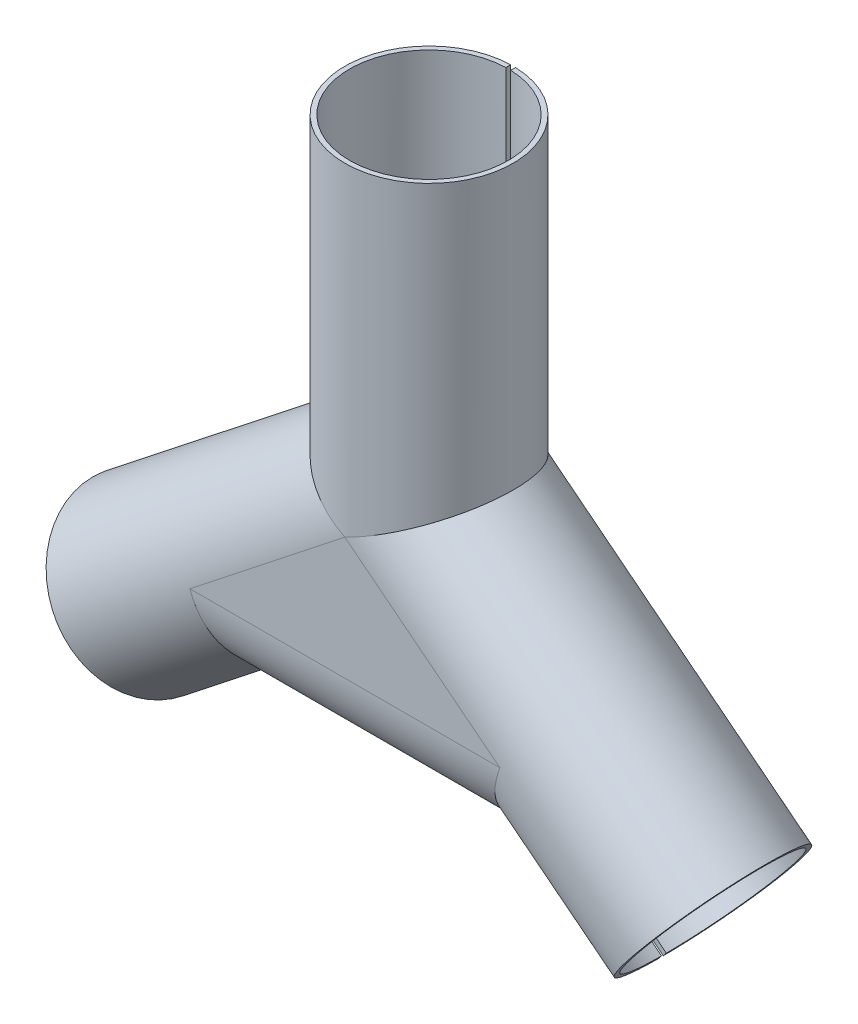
ISO-10303-21;
HEADER;
FILE_DESCRIPTION(('STEP AP214'),'2;1');
FILE_NAME('part.step','',(''),(''),'','','');
FILE_SCHEMA(('AUTOMOTIVE_DESIGN { 1 0 10303 214 1 1 1 1 }'));
ENDSEC;
DATA;
#1=APPLICATION_CONTEXT('core data for automotive mechanical design processes');
#2=APPLICATION_PROTOCOL_DEFINITION('international standard','automotive_design',2000,#1);
#3=PRODUCT_CONTEXT('',#1,'mechanical');
#4=PRODUCT('Part','Part','',(#3));
#5=PRODUCT_RELATED_PRODUCT_CATEGORY('part','',(#4));
#6=PRODUCT_DEFINITION_FORMATION('','',#4);
#7=PRODUCT_DEFINITION_CONTEXT('part definition',#1,'design');
#8=PRODUCT_DEFINITION('design','',#6,#7);
#9=PRODUCT_DEFINITION_SHAPE('','',#8);
#10=(LENGTH_UNIT() NAMED_UNIT(*) SI_UNIT(.MILLI.,.METRE.));
#11=(NAMED_UNIT(*) PLANE_ANGLE_UNIT() SI_UNIT($,.RADIAN.));
#12=(NAMED_UNIT(*) SI_UNIT($,.STERADIAN.) SOLID_ANGLE_UNIT());
#13=UNCERTAINTY_MEASURE_WITH_UNIT(LENGTH_MEASURE(1.E-05),#10,'distance_accuracy_value','');
#14=(GEOMETRIC_REPRESENTATION_CONTEXT(3) GLOBAL_UNCERTAINTY_ASSIGNED_CONTEXT((#13)) GLOBAL_UNIT_ASSIGNED_CONTEXT((#10,
#11,#12)) REPRESENTATION_CONTEXT('',''));
#15=CARTESIAN_POINT('',(0.,0.,0.));
#16=DIRECTION('',(0.,0.,1.));
#17=DIRECTION('',(1.,0.,0.));
#18=AXIS2_PLACEMENT_3D('',#15,#16,#17);
#19=CARTESIAN_POINT('',(0.,0.,0.));
#20=DIRECTION('',(-0.785370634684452,-0.619025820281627,0.));
#21=DIRECTION('',(-0.619025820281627,0.785370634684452,0.));
#22=AXIS2_PLACEMENT_3D('',#19,#20,#21);
#23=CYLINDRICAL_SURFACE('',#22,17.4844566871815);
#24=DIRECTION('',(-0.785370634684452,-0.619025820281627,0.));
#25=VECTOR('',#24,1.);
#26=CARTESIAN_POINT('',(10.8189036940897,-13.726162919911,0.5));
#27=LINE('',#26,#25);
#28=CARTESIAN_POINT('',(-48.1830101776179,-60.2312224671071,0.5));
#29=VERTEX_POINT('',#28);
#30=CARTESIAN_POINT('',(-26.1404437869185,-42.8573646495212,0.5));
#31=VERTEX_POINT('',#30);
#32=EDGE_CURVE('E195',#29,#31,#27,.F.);
#33=ORIENTED_EDGE('',*,*,#32,.T.);
#34=CARTESIAN_POINT('',(-32.2001960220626,-25.3800586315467,0.));
#35=DIRECTION('',(-0.944820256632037,-0.327589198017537,0.));
#36=DIRECTION('',(0.327589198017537,-0.944820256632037,0.));
#37=AXIS2_PLACEMENT_3D('',#34,#35,#36);
#38=ELLIPSE('',#37,18.5055904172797,17.4844566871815);
#39=CARTESIAN_POINT('',(-32.2001960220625,-25.3800586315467,17.4844566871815));
#40=VERTEX_POINT('',#39);
#41=EDGE_CURVE('E157',#40,#31,#38,.F.);
#42=ORIENTED_EDGE('',*,*,#41,.F.);
#43=DIRECTION('',(-0.785370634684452,-0.619025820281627,0.));
#44=VECTOR('',#43,1.);
#45=CARTESIAN_POINT('',(-32.2001960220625,-25.3800586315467,17.4844566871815));
#46=LINE('',#45,#44);
#47=CARTESIAN_POINT('',(0.,0.,17.4844566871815));
#48=VERTEX_POINT('',#47);
#49=EDGE_CURVE('E187',#48,#40,#46,.T.);
#50=ORIENTED_EDGE('',*,*,#49,.F.);
#51=CARTESIAN_POINT('',(0.,0.,0.));
#52=DIRECTION('',(-0.436448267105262,-0.899729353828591,0.));
#53=DIRECTION('',(-0.899729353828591,0.436448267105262,0.));
#54=AXIS2_PLACEMENT_3D('',#51,#52,#53);
#55=ELLIPSE('',#54,19.4330179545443,17.4844566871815);
#56=CARTESIAN_POINT('',(0.,0.,-17.4844566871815));
#57=VERTEX_POINT('',#56);
#58=EDGE_CURVE('E152',#57,#48,#55,.F.);
#59=ORIENTED_EDGE('',*,*,#58,.F.);
#60=DIRECTION('',(-0.785370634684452,-0.619025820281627,0.));
#61=VECTOR('',#60,1.);
#62=CARTESIAN_POINT('',(-32.2001960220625,-25.3800586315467,-17.4844566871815));
#63=LINE('',#62,#61);
#64=CARTESIAN_POINT('',(-32.2001960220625,-25.3800586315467,-17.4844566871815));
#65=VERTEX_POINT('',#64);
#66=EDGE_CURVE('E190',#57,#65,#63,.T.);
#67=ORIENTED_EDGE('',*,*,#66,.T.);
#68=CARTESIAN_POINT('',(-26.1404437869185,-42.8573646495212,-0.5));
#69=VERTEX_POINT('',#68);
#70=EDGE_CURVE('E202',#69,#65,#38,.F.);
#71=ORIENTED_EDGE('',*,*,#70,.F.);
#72=DIRECTION('',(-0.785370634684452,-0.619025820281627,0.));
#73=VECTOR('',#72,1.);
#74=CARTESIAN_POINT('',(10.8189036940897,-13.726162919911,-0.5));
#75=LINE('',#74,#73);
#76=CARTESIAN_POINT('',(-48.1830101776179,-60.2312224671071,-0.5));
#77=VERTEX_POINT('',#76);
#78=EDGE_CURVE('E146',#77,#69,#75,.F.);
#79=ORIENTED_EDGE('',*,*,#78,.F.);
#80=CARTESIAN_POINT('',(-59.0019138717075,-46.5050595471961,0.));
#81=DIRECTION('',(0.785370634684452,0.619025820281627,0.));
#82=DIRECTION('',(-0.619025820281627,0.785370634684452,0.));
#83=AXIS2_PLACEMENT_3D('',#80,#81,#82);
#84=CIRCLE('',#83,17.4844566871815);
#85=EDGE_CURVE('E138',#77,#29,#84,.T.);
#86=ORIENTED_EDGE('',*,*,#85,.T.);
#87=EDGE_LOOP('',(#33,#42,#50,#59,#67,#71,#79,#86));
#88=FACE_BOUND('',#87,.T.);
#89=ADVANCED_FACE('F69',(#88),#23,.T.);
#90=CARTESIAN_POINT('',(-26.1379644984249,-42.8645153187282,-17.4844566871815));
#91=DIRECTION('',(0.944820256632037,0.327589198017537,0.));
#92=DIRECTION('',(0.327589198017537,-0.944820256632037,0.));
#93=AXIS2_PLACEMENT_3D('',#90,#91,#92);
#94=PLANE('',#93);
#95=ORIENTED_EDGE('',*,*,#70,.T.);
#96=DIRECTION('',(0.,0.,1.));
#97=VECTOR('',#96,1.);
#98=CARTESIAN_POINT('',(-32.2001960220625,-25.3800586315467,-17.4844566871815));
#99=LINE('',#98,#97);
#100=CARTESIAN_POINT('',(-32.2001960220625,-25.3800586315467,-16.4844566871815));
#101=VERTEX_POINT('',#100);
#102=EDGE_CURVE('E182',#65,#101,#99,.T.);
#103=ORIENTED_EDGE('',*,*,#102,.T.);
#104=CARTESIAN_POINT('',(-32.2001960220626,-25.3800586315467,0.));
#105=DIRECTION('',(-0.944820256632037,-0.327589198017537,0.));
#106=DIRECTION('',(0.327589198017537,-0.944820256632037,0.));
#107=AXIS2_PLACEMENT_3D('',#104,#105,#106);
#108=ELLIPSE('',#107,17.4471880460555,16.4844566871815);
#109=CARTESIAN_POINT('',(-26.487315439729,-41.8569306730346,-0.5));
#110=VERTEX_POINT('',#109);
#111=EDGE_CURVE('E154',#110,#101,#108,.F.);
#112=ORIENTED_EDGE('',*,*,#111,.F.);
#113=DIRECTION('',(-0.327589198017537,0.944820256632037,0.));
#114=VECTOR('',#113,1.);
#115=CARTESIAN_POINT('',(-26.1379644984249,-42.8645153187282,-0.5));
#116=LINE('',#115,#114);
#117=EDGE_CURVE('E76',#69,#110,#116,.T.);
#118=ORIENTED_EDGE('',*,*,#117,.F.);
#119=EDGE_LOOP('',(#95,#103,#112,#118));
#120=FACE_BOUND('',#119,.T.);
#121=ADVANCED_FACE('F207',(#120),#94,.T.);
#122=CARTESIAN_POINT('',(0.,0.,0.));
#123=DIRECTION('',(-0.785370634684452,-0.619025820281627,0.));
#124=DIRECTION('',(-0.619025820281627,0.785370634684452,0.));
#125=AXIS2_PLACEMENT_3D('',#122,#123,#124);
#126=CYLINDRICAL_SURFACE('',#125,16.4844566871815);
#127=CARTESIAN_POINT('',(-59.0019138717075,-46.5050595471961,0.));
#128=DIRECTION('',(0.785370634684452,0.619025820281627,0.));
#129=DIRECTION('',(0.,0.,-1.));
#130=AXIS2_PLACEMENT_3D('',#127,#128,#129);
#131=CIRCLE('',#130,16.4844566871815);
#132=CARTESIAN_POINT('',(-48.8023046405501,-59.4455110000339,-0.5));
#133=VERTEX_POINT('',#132);
#134=CARTESIAN_POINT('',(-48.8023046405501,-59.4455110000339,0.5));
#135=VERTEX_POINT('',#134);
#136=EDGE_CURVE('E136',#133,#135,#131,.T.);
#137=ORIENTED_EDGE('',*,*,#136,.F.);
#138=DIRECTION('',(-0.785370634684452,-0.619025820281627,0.));
#139=VECTOR('',#138,1.);
#140=CARTESIAN_POINT('',(10.1996092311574,-12.9404514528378,-0.5));
#141=LINE('',#140,#139);
#142=EDGE_CURVE('E83',#133,#110,#141,.F.);
#143=ORIENTED_EDGE('',*,*,#142,.T.);
#144=ORIENTED_EDGE('',*,*,#111,.T.);
#145=DIRECTION('',(-0.785370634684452,-0.619025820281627,0.));
#146=VECTOR('',#145,1.);
#147=CARTESIAN_POINT('',(0.,0.,-16.4844566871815));
#148=LINE('',#147,#146);
#149=CARTESIAN_POINT('',(0.,0.,-16.4844566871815));
#150=VERTEX_POINT('',#149);
#151=EDGE_CURVE('E166',#101,#150,#148,.F.);
#152=ORIENTED_EDGE('',*,*,#151,.T.);
#153=CARTESIAN_POINT('',(0.,0.,0.));
#154=DIRECTION('',(-0.436448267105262,-0.899729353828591,0.));
#155=DIRECTION('',(-0.899729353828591,0.436448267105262,0.));
#156=AXIS2_PLACEMENT_3D('',#153,#154,#155);
#157=ELLIPSE('',#156,18.3215726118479,16.4844566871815);
#158=CARTESIAN_POINT('',(0.,0.,16.4844566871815));
#159=VERTEX_POINT('',#158);
#160=EDGE_CURVE('E169',#150,#159,#157,.F.);
#161=ORIENTED_EDGE('',*,*,#160,.T.);
#162=DIRECTION('',(-0.785370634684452,-0.619025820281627,0.));
#163=VECTOR('',#162,1.);
#164=CARTESIAN_POINT('',(0.,0.,16.4844566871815));
#165=LINE('',#164,#163);
#166=CARTESIAN_POINT('',(-32.2001960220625,-25.3800586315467,16.4844566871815));
#167=VERTEX_POINT('',#166);
#168=EDGE_CURVE('E163',#159,#167,#165,.T.);
#169=ORIENTED_EDGE('',*,*,#168,.T.);
#170=CARTESIAN_POINT('',(-26.487315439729,-41.8569306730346,0.5));
#171=VERTEX_POINT('',#170);
#172=EDGE_CURVE('E161',#167,#171,#108,.F.);
#173=ORIENTED_EDGE('',*,*,#172,.T.);
#174=DIRECTION('',(-0.785370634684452,-0.619025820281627,0.));
#175=VECTOR('',#174,1.);
#176=CARTESIAN_POINT('',(10.1996092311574,-12.9404514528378,0.5));
#177=LINE('',#176,#175);
#178=EDGE_CURVE('E151',#135,#171,#177,.F.);
#179=ORIENTED_EDGE('',*,*,#178,.F.);
#180=EDGE_LOOP('',(#137,#143,#144,#152,#161,#169,#173,#179));
#181=FACE_BOUND('',#180,.T.);
#182=ADVANCED_FACE('F149',(#181),#126,.F.);
#183=CARTESIAN_POINT('',(-59.0019138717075,-46.5050595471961,0.));
#184=DIRECTION('',(-0.785370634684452,-0.619025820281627,0.));
#185=DIRECTION('',(-0.619025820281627,0.785370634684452,0.));
#186=AXIS2_PLACEMENT_3D('',#183,#184,#185);
#187=PLANE('',#186);
#188=DIRECTION('',(-0.619025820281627,0.785370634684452,0.));
#189=VECTOR('',#188,1.);
#190=CARTESIAN_POINT('',(-59.0019138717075,-46.5050595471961,0.5));
#191=LINE('',#190,#189);
#192=EDGE_CURVE('E142',#135,#29,#191,.F.);
#193=ORIENTED_EDGE('',*,*,#192,.T.);
#194=ORIENTED_EDGE('',*,*,#85,.F.);
#195=DIRECTION('',(-0.619025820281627,0.785370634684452,0.));
#196=VECTOR('',#195,1.);
#197=CARTESIAN_POINT('',(-59.0019138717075,-46.5050595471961,-0.5));
#198=LINE('',#197,#196);
#199=EDGE_CURVE('E134',#133,#77,#198,.F.);
#200=ORIENTED_EDGE('',*,*,#199,.F.);
#201=ORIENTED_EDGE('',*,*,#136,.T.);
#202=EDGE_LOOP('',(#193,#194,#200,#201));
#203=FACE_BOUND('',#202,.T.);
#204=ADVANCED_FACE('F135',(#203),#187,.T.);
#205=CARTESIAN_POINT('',(-32.2001960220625,-25.3800586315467,-17.4844566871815));
#206=DIRECTION('',(0.619025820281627,-0.785370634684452,0.));
#207=DIRECTION('',(-0.785370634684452,-0.619025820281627,0.));
#208=AXIS2_PLACEMENT_3D('',#205,#206,#207);
#209=PLANE('',#208);
#210=ORIENTED_EDGE('',*,*,#151,.F.);
#211=ORIENTED_EDGE('',*,*,#102,.F.);
#212=ORIENTED_EDGE('',*,*,#66,.F.);
#213=DIRECTION('',(0.,0.,1.));
#214=VECTOR('',#213,1.);
#215=CARTESIAN_POINT('',(0.,0.,-17.4844566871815));
#216=LINE('',#215,#214);
#217=EDGE_CURVE('E175',#57,#150,#216,.T.);
#218=ORIENTED_EDGE('',*,*,#217,.T.);
#219=EDGE_LOOP('',(#210,#211,#212,#218));
#220=FACE_BOUND('',#219,.T.);
#221=ADVANCED_FACE('F210',(#220),#209,.T.);
#222=ORIENTED_EDGE('',*,*,#168,.F.);
#223=EDGE_CURVE('E177',#159,#48,#216,.T.);
#224=ORIENTED_EDGE('',*,*,#223,.T.);
#225=ORIENTED_EDGE('',*,*,#49,.T.);
#226=EDGE_CURVE('E185',#167,#40,#99,.T.);
#227=ORIENTED_EDGE('',*,*,#226,.F.);
#228=EDGE_LOOP('',(#222,#224,#225,#227));
#229=FACE_BOUND('',#228,.T.);
#230=ADVANCED_FACE('F184',(#229),#209,.T.);
#231=CARTESIAN_POINT('',(0.,0.,-17.4844566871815));
#232=DIRECTION('',(0.436448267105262,0.899729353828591,0.));
#233=DIRECTION('',(0.899729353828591,-0.436448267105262,0.));
#234=AXIS2_PLACEMENT_3D('',#231,#232,#233);
#235=PLANE('',#234);
#236=ORIENTED_EDGE('',*,*,#58,.T.);
#237=ORIENTED_EDGE('',*,*,#223,.F.);
#238=ORIENTED_EDGE('',*,*,#160,.F.);
#239=ORIENTED_EDGE('',*,*,#217,.F.);
#240=EDGE_LOOP('',(#236,#237,#238,#239));
#241=FACE_BOUND('',#240,.T.);
#242=ADVANCED_FACE('F174',(#241),#235,.T.);
#243=DIRECTION('',(-0.327589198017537,0.944820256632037,0.));
#244=VECTOR('',#243,1.);
#245=CARTESIAN_POINT('',(-26.1379644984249,-42.8645153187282,0.5));
#246=LINE('',#245,#244);
#247=EDGE_CURVE('E14',#31,#171,#246,.T.);
#248=ORIENTED_EDGE('',*,*,#247,.T.);
#249=ORIENTED_EDGE('',*,*,#172,.F.);
#250=ORIENTED_EDGE('',*,*,#226,.T.);
#251=ORIENTED_EDGE('',*,*,#41,.T.);
#252=EDGE_LOOP('',(#248,#249,#250,#251));
#253=FACE_BOUND('',#252,.T.);
#254=ADVANCED_FACE('F192',(#253),#94,.T.);
#255=CARTESIAN_POINT('',(52.5746819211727,41.4391424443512,-0.5));
#256=DIRECTION('',(0.,0.,1.));
#257=DIRECTION('',(-1.,0.,0.));
#258=AXIS2_PLACEMENT_3D('',#255,#256,#257);
#259=PLANE('',#258);
#260=ORIENTED_EDGE('',*,*,#199,.T.);
#261=ORIENTED_EDGE('',*,*,#78,.T.);
#262=ORIENTED_EDGE('',*,*,#117,.T.);
#263=ORIENTED_EDGE('',*,*,#142,.F.);
#264=EDGE_LOOP('',(#260,#261,#262,#263));
#265=FACE_BOUND('',#264,.T.);
#266=ADVANCED_FACE('F144',(#265),#259,.T.);
#267=CARTESIAN_POINT('',(52.5746819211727,41.4391424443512,0.5));
#268=DIRECTION('',(0.,0.,1.));
#269=DIRECTION('',(-1.,0.,0.));
#270=AXIS2_PLACEMENT_3D('',#267,#268,#269);
#271=PLANE('',#270);
#272=ORIENTED_EDGE('',*,*,#32,.F.);
#273=ORIENTED_EDGE('',*,*,#192,.F.);
#274=ORIENTED_EDGE('',*,*,#178,.T.);
#275=ORIENTED_EDGE('',*,*,#247,.F.);
#276=EDGE_LOOP('',(#272,#273,#274,#275));
#277=FACE_BOUND('',#276,.T.);
#278=ADVANCED_FACE('F194',(#277),#271,.F.);
#279=CLOSED_SHELL('',(#89,#121,#182,#204,#221,#230,#242,#254,#266,#278));
#280=MANIFOLD_SOLID_BREP('B2',#279);
#281=CARTESIAN_POINT('',(-32.2001960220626,-25.3800586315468,0.));
#282=DIRECTION('',(1.,0.,0.));
#283=DIRECTION('',(0.,1.,0.));
#284=AXIS2_PLACEMENT_3D('',#281,#282,#283);
#285=CYLINDRICAL_SURFACE('',#284,16.4844566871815);
#286=CARTESIAN_POINT('',(-32.2001960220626,-25.3800586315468,0.));
#287=DIRECTION('',(-0.944820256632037,-0.327589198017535,0.));
#288=DIRECTION('',(0.327589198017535,-0.944820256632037,0.));
#289=AXIS2_PLACEMENT_3D('',#286,#287,#288);
#290=ELLIPSE('',#289,17.4471880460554,16.4844566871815);
#291=CARTESIAN_POINT('',(-32.2001960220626,-25.3800586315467,16.4844566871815));
#292=VERTEX_POINT('',#291);
#293=CARTESIAN_POINT('',(-32.2001960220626,-25.3800586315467,-16.4844566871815));
#294=VERTEX_POINT('',#293);
#295=EDGE_CURVE('E67',#292,#294,#290,.F.);
#296=ORIENTED_EDGE('',*,*,#295,.F.);
#297=DIRECTION('',(1.,0.,0.));
#298=VECTOR('',#297,1.);
#299=CARTESIAN_POINT('',(-32.2001960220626,-25.3800586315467,16.4844566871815));
#300=LINE('',#299,#298);
#301=CARTESIAN_POINT('',(32.2001960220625,-25.3800586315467,16.4844566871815));
#302=VERTEX_POINT('',#301);
#303=EDGE_CURVE('E409',#302,#292,#300,.F.);
#304=ORIENTED_EDGE('',*,*,#303,.F.);
#305=CARTESIAN_POINT('',(32.2001960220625,-25.3800586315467,0.));
#306=DIRECTION('',(0.944820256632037,-0.327589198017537,0.));
#307=DIRECTION('',(0.327589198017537,0.944820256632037,0.));
#308=AXIS2_PLACEMENT_3D('',#305,#306,#307);
#309=ELLIPSE('',#308,17.4471880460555,16.4844566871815);
#310=CARTESIAN_POINT('',(32.2001960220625,-25.3800586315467,-16.4844566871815));
#311=VERTEX_POINT('',#310);
#312=EDGE_CURVE('E401',#311,#302,#309,.F.);
#313=ORIENTED_EDGE('',*,*,#312,.F.);
#314=DIRECTION('',(1.,0.,0.));
#315=VECTOR('',#314,1.);
#316=CARTESIAN_POINT('',(-32.2001960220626,-25.3800586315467,-16.4844566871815));
#317=LINE('',#316,#315);
#318=EDGE_CURVE('E372',#294,#311,#317,.T.);
#319=ORIENTED_EDGE('',*,*,#318,.F.);
#320=EDGE_LOOP('',(#296,#304,#313,#319));
#321=FACE_BOUND('',#320,.T.);
#322=ADVANCED_FACE('F301',(#321),#285,.F.);
#323=CARTESIAN_POINT('',(-26.137964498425,-42.8645153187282,-17.4844566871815));
#324=DIRECTION('',(-0.944820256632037,-0.327589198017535,0.));
#325=DIRECTION('',(0.327589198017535,-0.944820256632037,0.));
#326=AXIS2_PLACEMENT_3D('',#323,#324,#325);
#327=PLANE('',#326);
#328=CARTESIAN_POINT('',(-32.2001960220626,-25.3800586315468,0.));
#329=DIRECTION('',(-0.944820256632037,-0.327589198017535,0.));
#330=DIRECTION('',(0.327589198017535,-0.944820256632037,0.));
#331=AXIS2_PLACEMENT_3D('',#328,#329,#330);
#332=ELLIPSE('',#331,18.5055904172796,17.4844566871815);
#333=CARTESIAN_POINT('',(-32.2001960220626,-25.3800586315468,17.4844566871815));
#334=VERTEX_POINT('',#333);
#335=CARTESIAN_POINT('',(-32.2001960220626,-25.3800586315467,-17.4844566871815));
#336=VERTEX_POINT('',#335);
#337=EDGE_CURVE('E309',#334,#336,#332,.F.);
#338=ORIENTED_EDGE('',*,*,#337,.F.);
#339=DIRECTION('',(0.,0.,1.));
#340=VECTOR('',#339,1.);
#341=CARTESIAN_POINT('',(-32.2001960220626,-25.3800586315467,-17.4844566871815));
#342=LINE('',#341,#340);
#343=EDGE_CURVE('E402',#292,#334,#342,.T.);
#344=ORIENTED_EDGE('',*,*,#343,.F.);
#345=ORIENTED_EDGE('',*,*,#295,.T.);
#346=EDGE_CURVE('E364',#336,#294,#342,.T.);
#347=ORIENTED_EDGE('',*,*,#346,.F.);
#348=EDGE_LOOP('',(#338,#344,#345,#347));
#349=FACE_BOUND('',#348,.T.);
#350=ADVANCED_FACE('F427',(#349),#327,.T.);
#351=CARTESIAN_POINT('',(26.1379644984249,-42.8645153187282,-17.4844566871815));
#352=DIRECTION('',(0.944820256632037,-0.327589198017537,0.));
#353=DIRECTION('',(0.327589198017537,0.944820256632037,0.));
#354=AXIS2_PLACEMENT_3D('',#351,#352,#353);
#355=PLANE('',#354);
#356=DIRECTION('',(0.,0.,1.));
#357=VECTOR('',#356,1.);
#358=CARTESIAN_POINT('',(32.2001960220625,-25.3800586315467,-17.4844566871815));
#359=LINE('',#358,#357);
#360=CARTESIAN_POINT('',(32.2001960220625,-25.3800586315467,-17.4844566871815));
#361=VERTEX_POINT('',#360);
#362=EDGE_CURVE('E324',#361,#311,#359,.T.);
#363=ORIENTED_EDGE('',*,*,#362,.T.);
#364=ORIENTED_EDGE('',*,*,#312,.T.);
#365=CARTESIAN_POINT('',(32.2001960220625,-25.3800586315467,17.4844566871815));
#366=VERTEX_POINT('',#365);
#367=EDGE_CURVE('E399',#302,#366,#359,.T.);
#368=ORIENTED_EDGE('',*,*,#367,.T.);
#369=CARTESIAN_POINT('',(32.2001960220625,-25.3800586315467,0.));
#370=DIRECTION('',(0.944820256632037,-0.327589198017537,0.));
#371=DIRECTION('',(0.327589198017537,0.944820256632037,0.));
#372=AXIS2_PLACEMENT_3D('',#369,#370,#371);
#373=ELLIPSE('',#372,18.5055904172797,17.4844566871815);
#374=EDGE_CURVE('E405',#361,#366,#373,.F.);
#375=ORIENTED_EDGE('',*,*,#374,.F.);
#376=EDGE_LOOP('',(#363,#364,#368,#375));
#377=FACE_BOUND('',#376,.T.);
#378=ADVANCED_FACE('F432',(#377),#355,.T.);
#379=CARTESIAN_POINT('',(-32.2001960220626,-25.3800586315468,0.));
#380=DIRECTION('',(1.,0.,0.));
#381=DIRECTION('',(0.,1.,0.));
#382=AXIS2_PLACEMENT_3D('',#379,#380,#381);
#383=CYLINDRICAL_SURFACE('',#382,17.4844566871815);
#384=ORIENTED_EDGE('',*,*,#374,.T.);
#385=DIRECTION('',(-1.,0.,0.));
#386=VECTOR('',#385,1.);
#387=CARTESIAN_POINT('',(-32.2001960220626,-25.3800586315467,17.4844566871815));
#388=LINE('',#387,#386);
#389=EDGE_CURVE('E393',#366,#334,#388,.T.);
#390=ORIENTED_EDGE('',*,*,#389,.T.);
#391=ORIENTED_EDGE('',*,*,#337,.T.);
#392=DIRECTION('',(-1.,0.,0.));
#393=VECTOR('',#392,1.);
#394=CARTESIAN_POINT('',(-32.2001960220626,-25.3800586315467,-17.4844566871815));
#395=LINE('',#394,#393);
#396=EDGE_CURVE('E396',#361,#336,#395,.T.);
#397=ORIENTED_EDGE('',*,*,#396,.F.);
#398=EDGE_LOOP('',(#384,#390,#391,#397));
#399=FACE_BOUND('',#398,.T.);
#400=ADVANCED_FACE('F303',(#399),#383,.T.);
#401=CARTESIAN_POINT('',(32.2001960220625,-25.3800586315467,16.4844566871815));
#402=DIRECTION('',(0.619025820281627,0.785370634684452,0.));
#403=DIRECTION('',(-0.785370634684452,0.619025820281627,0.));
#404=AXIS2_PLACEMENT_3D('',#401,#402,#403);
#405=PLANE('',#404);
#406=DIRECTION('',(-0.785370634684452,0.619025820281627,0.));
#407=VECTOR('',#406,1.);
#408=CARTESIAN_POINT('',(32.2001960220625,-25.3800586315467,17.4844566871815));
#409=LINE('',#408,#407);
#410=CARTESIAN_POINT('',(0.,0.,17.4844566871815));
#411=VERTEX_POINT('',#410);
#412=EDGE_CURVE('E379',#366,#411,#409,.T.);
#413=ORIENTED_EDGE('',*,*,#412,.F.);
#414=ORIENTED_EDGE('',*,*,#367,.F.);
#415=DIRECTION('',(-0.785370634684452,0.619025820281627,0.));
#416=VECTOR('',#415,1.);
#417=CARTESIAN_POINT('',(32.2001960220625,-25.3800586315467,16.4844566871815));
#418=LINE('',#417,#416);
#419=CARTESIAN_POINT('',(0.,0.,16.4844566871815));
#420=VERTEX_POINT('',#419);
#421=EDGE_CURVE('E385',#302,#420,#418,.T.);
#422=ORIENTED_EDGE('',*,*,#421,.T.);
#423=DIRECTION('',(0.,0.,1.));
#424=VECTOR('',#423,1.);
#425=CARTESIAN_POINT('',(0.,0.,16.4844566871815));
#426=LINE('',#425,#424);
#427=EDGE_CURVE('E389',#420,#411,#426,.T.);
#428=ORIENTED_EDGE('',*,*,#427,.T.);
#429=EDGE_LOOP('',(#413,#414,#422,#428));
#430=FACE_BOUND('',#429,.T.);
#431=ADVANCED_FACE('F438',(#430),#405,.T.);
#432=CARTESIAN_POINT('',(0.,0.,16.4844566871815));
#433=DIRECTION('',(-0.619025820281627,0.785370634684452,0.));
#434=DIRECTION('',(-0.785370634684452,-0.619025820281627,0.));
#435=AXIS2_PLACEMENT_3D('',#432,#433,#434);
#436=PLANE('',#435);
#437=DIRECTION('',(-0.785370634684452,-0.619025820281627,0.));
#438=VECTOR('',#437,1.);
#439=CARTESIAN_POINT('',(0.,0.,17.4844566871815));
#440=LINE('',#439,#438);
#441=EDGE_CURVE('E316',#411,#334,#440,.T.);
#442=ORIENTED_EDGE('',*,*,#441,.F.);
#443=ORIENTED_EDGE('',*,*,#427,.F.);
#444=DIRECTION('',(-0.785370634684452,-0.619025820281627,0.));
#445=VECTOR('',#444,1.);
#446=CARTESIAN_POINT('',(0.,0.,16.4844566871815));
#447=LINE('',#446,#445);
#448=EDGE_CURVE('E388',#420,#292,#447,.T.);
#449=ORIENTED_EDGE('',*,*,#448,.T.);
#450=ORIENTED_EDGE('',*,*,#343,.T.);
#451=EDGE_LOOP('',(#442,#443,#449,#450));
#452=FACE_BOUND('',#451,.T.);
#453=ADVANCED_FACE('F441',(#452),#436,.T.);
#454=CARTESIAN_POINT('',(0.,0.,16.4844566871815));
#455=DIRECTION('',(0.,0.,1.));
#456=DIRECTION('',(1.,0.,0.));
#457=AXIS2_PLACEMENT_3D('',#454,#455,#456);
#458=PLANE('',#457);
#459=ORIENTED_EDGE('',*,*,#421,.F.);
#460=ORIENTED_EDGE('',*,*,#303,.T.);
#461=ORIENTED_EDGE('',*,*,#448,.F.);
#462=EDGE_LOOP('',(#459,#460,#461));
#463=FACE_BOUND('',#462,.T.);
#464=ADVANCED_FACE('F445',(#463),#458,.F.);
#465=CARTESIAN_POINT('',(0.,0.,17.4844566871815));
#466=DIRECTION('',(0.,0.,1.));
#467=DIRECTION('',(1.,0.,0.));
#468=AXIS2_PLACEMENT_3D('',#465,#466,#467);
#469=PLANE('',#468);
#470=ORIENTED_EDGE('',*,*,#412,.T.);
#471=ORIENTED_EDGE('',*,*,#441,.T.);
#472=ORIENTED_EDGE('',*,*,#389,.F.);
#473=EDGE_LOOP('',(#470,#471,#472));
#474=FACE_BOUND('',#473,.T.);
#475=ADVANCED_FACE('F447',(#474),#469,.T.);
#476=CARTESIAN_POINT('',(32.2001960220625,-25.3800586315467,-16.4844566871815));
#477=DIRECTION('',(-0.619025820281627,-0.785370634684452,0.));
#478=DIRECTION('',(0.785370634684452,-0.619025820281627,0.));
#479=AXIS2_PLACEMENT_3D('',#476,#477,#478);
#480=PLANE('',#479);
#481=DIRECTION('',(-0.785370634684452,0.619025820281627,0.));
#482=VECTOR('',#481,1.);
#483=CARTESIAN_POINT('',(32.2001960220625,-25.3800586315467,-17.4844566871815));
#484=LINE('',#483,#482);
#485=CARTESIAN_POINT('',(0.,0.,-17.4844566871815));
#486=VERTEX_POINT('',#485);
#487=EDGE_CURVE('E378',#361,#486,#484,.T.);
#488=ORIENTED_EDGE('',*,*,#487,.T.);
#489=DIRECTION('',(0.,0.,-1.));
#490=VECTOR('',#489,1.);
#491=CARTESIAN_POINT('',(0.,0.,-16.4844566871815));
#492=LINE('',#491,#490);
#493=CARTESIAN_POINT('',(0.,0.,-16.4844566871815));
#494=VERTEX_POINT('',#493);
#495=EDGE_CURVE('E362',#494,#486,#492,.T.);
#496=ORIENTED_EDGE('',*,*,#495,.F.);
#497=DIRECTION('',(-0.785370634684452,0.619025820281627,0.));
#498=VECTOR('',#497,1.);
#499=CARTESIAN_POINT('',(32.2001960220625,-25.3800586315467,-16.4844566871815));
#500=LINE('',#499,#498);
#501=EDGE_CURVE('E367',#311,#494,#500,.T.);
#502=ORIENTED_EDGE('',*,*,#501,.F.);
#503=ORIENTED_EDGE('',*,*,#362,.F.);
#504=EDGE_LOOP('',(#488,#496,#502,#503));
#505=FACE_BOUND('',#504,.T.);
#506=ADVANCED_FACE('F376',(#505),#480,.F.);
#507=CARTESIAN_POINT('',(0.,0.,-16.4844566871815));
#508=DIRECTION('',(0.619025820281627,-0.785370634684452,0.));
#509=DIRECTION('',(0.785370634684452,0.619025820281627,0.));
#510=AXIS2_PLACEMENT_3D('',#507,#508,#509);
#511=PLANE('',#510);
#512=DIRECTION('',(-0.785370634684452,-0.619025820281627,0.));
#513=VECTOR('',#512,1.);
#514=CARTESIAN_POINT('',(0.,0.,-17.4844566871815));
#515=LINE('',#514,#513);
#516=EDGE_CURVE('E374',#486,#336,#515,.T.);
#517=ORIENTED_EDGE('',*,*,#516,.T.);
#518=ORIENTED_EDGE('',*,*,#346,.T.);
#519=DIRECTION('',(-0.785370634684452,-0.619025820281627,0.));
#520=VECTOR('',#519,1.);
#521=CARTESIAN_POINT('',(0.,0.,-16.4844566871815));
#522=LINE('',#521,#520);
#523=EDGE_CURVE('E357',#494,#294,#522,.T.);
#524=ORIENTED_EDGE('',*,*,#523,.F.);
#525=ORIENTED_EDGE('',*,*,#495,.T.);
#526=EDGE_LOOP('',(#517,#518,#524,#525));
#527=FACE_BOUND('',#526,.T.);
#528=ADVANCED_FACE('F360',(#527),#511,.F.);
#529=CARTESIAN_POINT('',(0.,0.,-16.4844566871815));
#530=DIRECTION('',(0.,0.,-1.));
#531=DIRECTION('',(1.,0.,0.));
#532=AXIS2_PLACEMENT_3D('',#529,#530,#531);
#533=PLANE('',#532);
#534=ORIENTED_EDGE('',*,*,#501,.T.);
#535=ORIENTED_EDGE('',*,*,#523,.T.);
#536=ORIENTED_EDGE('',*,*,#318,.T.);
#537=EDGE_LOOP('',(#534,#535,#536));
#538=FACE_BOUND('',#537,.T.);
#539=ADVANCED_FACE('F370',(#538),#533,.F.);
#540=CARTESIAN_POINT('',(0.,0.,-17.4844566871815));
#541=DIRECTION('',(0.,0.,-1.));
#542=DIRECTION('',(1.,0.,0.));
#543=AXIS2_PLACEMENT_3D('',#540,#541,#542);
#544=PLANE('',#543);
#545=ORIENTED_EDGE('',*,*,#487,.F.);
#546=ORIENTED_EDGE('',*,*,#396,.T.);
#547=ORIENTED_EDGE('',*,*,#516,.F.);
#548=EDGE_LOOP('',(#545,#546,#547));
#549=FACE_BOUND('',#548,.T.);
#550=ADVANCED_FACE('F418',(#549),#544,.T.);
#551=CLOSED_SHELL('',(#322,#350,#378,#400,#431,#453,#464,#475,#506,#528,#539,#550));
#552=MANIFOLD_SOLID_BREP('B8',#551);
#553=CARTESIAN_POINT('',(0.,0.,0.));
#554=DIRECTION('',(0.785370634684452,-0.619025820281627,0.));
#555=DIRECTION('',(0.619025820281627,0.785370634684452,0.));
#556=AXIS2_PLACEMENT_3D('',#553,#554,#555);
#557=CYLINDRICAL_SURFACE('',#556,17.4844566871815);
#558=DIRECTION('',(0.785370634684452,-0.619025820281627,0.));
#559=VECTOR('',#558,1.);
#560=CARTESIAN_POINT('',(-10.8189036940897,-13.726162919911,0.5));
#561=LINE('',#560,#559);
#562=CARTESIAN_POINT('',(48.1830101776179,-60.2312224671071,0.5));
#563=VERTEX_POINT('',#562);
#564=CARTESIAN_POINT('',(26.1404437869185,-42.8573646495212,0.5));
#565=VERTEX_POINT('',#564);
#566=EDGE_CURVE('E561',#563,#565,#561,.F.);
#567=ORIENTED_EDGE('',*,*,#566,.F.);
#568=CARTESIAN_POINT('',(59.0019138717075,-46.5050595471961,0.));
#569=DIRECTION('',(0.785370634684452,-0.619025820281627,0.));
#570=DIRECTION('',(0.619025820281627,0.785370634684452,0.));
#571=AXIS2_PLACEMENT_3D('',#568,#569,#570);
#572=CIRCLE('',#571,17.4844566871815);
#573=CARTESIAN_POINT('',(48.1830101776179,-60.2312224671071,-0.5));
#574=VERTEX_POINT('',#573);
#575=EDGE_CURVE('E622',#574,#563,#572,.T.);
#576=ORIENTED_EDGE('',*,*,#575,.F.);
#577=DIRECTION('',(0.785370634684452,-0.619025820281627,0.));
#578=VECTOR('',#577,1.);
#579=CARTESIAN_POINT('',(-10.8189036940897,-13.726162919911,-0.5));
#580=LINE('',#579,#578);
#581=CARTESIAN_POINT('',(26.1404437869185,-42.8573646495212,-0.5));
#582=VERTEX_POINT('',#581);
#583=EDGE_CURVE('E604',#574,#582,#580,.F.);
#584=ORIENTED_EDGE('',*,*,#583,.T.);
#585=CARTESIAN_POINT('',(32.2001960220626,-25.3800586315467,0.));
#586=DIRECTION('',(-0.944820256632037,0.327589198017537,0.));
#587=DIRECTION('',(-0.327589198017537,-0.944820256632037,0.));
#588=AXIS2_PLACEMENT_3D('',#585,#586,#587);
#589=ELLIPSE('',#588,18.5055904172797,17.4844566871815);
#590=CARTESIAN_POINT('',(32.2001960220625,-25.3800586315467,-17.4844566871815));
#591=VERTEX_POINT('',#590);
#592=EDGE_CURVE('E644',#582,#591,#589,.F.);
#593=ORIENTED_EDGE('',*,*,#592,.T.);
#594=DIRECTION('',(0.785370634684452,-0.619025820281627,0.));
#595=VECTOR('',#594,1.);
#596=CARTESIAN_POINT('',(32.2001960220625,-25.3800586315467,-17.4844566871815));
#597=LINE('',#596,#595);
#598=CARTESIAN_POINT('',(0.,0.,-17.4844566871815));
#599=VERTEX_POINT('',#598);
#600=EDGE_CURVE('E655',#599,#591,#597,.T.);
#601=ORIENTED_EDGE('',*,*,#600,.F.);
#602=CARTESIAN_POINT('',(0.,0.,0.));
#603=DIRECTION('',(-0.436448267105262,0.899729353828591,0.));
#604=DIRECTION('',(0.899729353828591,0.436448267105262,0.));
#605=AXIS2_PLACEMENT_3D('',#602,#603,#604);
#606=ELLIPSE('',#605,19.4330179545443,17.4844566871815);
#607=CARTESIAN_POINT('',(0.,0.,17.4844566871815));
#608=VERTEX_POINT('',#607);
#609=EDGE_CURVE('E623',#599,#608,#606,.F.);
#610=ORIENTED_EDGE('',*,*,#609,.T.);
#611=DIRECTION('',(0.785370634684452,-0.619025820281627,0.));
#612=VECTOR('',#611,1.);
#613=CARTESIAN_POINT('',(32.2001960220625,-25.3800586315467,17.4844566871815));
#614=LINE('',#613,#612);
#615=CARTESIAN_POINT('',(32.2001960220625,-25.3800586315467,17.4844566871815));
#616=VERTEX_POINT('',#615);
#617=EDGE_CURVE('E652',#608,#616,#614,.T.);
#618=ORIENTED_EDGE('',*,*,#617,.T.);
#619=EDGE_CURVE('E626',#616,#565,#589,.F.);
#620=ORIENTED_EDGE('',*,*,#619,.T.);
#621=EDGE_LOOP('',(#567,#576,#584,#593,#601,#610,#618,#620));
#622=FACE_BOUND('',#621,.T.);
#623=ADVANCED_FACE('F540',(#622),#557,.T.);
#624=CARTESIAN_POINT('',(26.1379644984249,-42.8645153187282,-17.4844566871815));
#625=DIRECTION('',(-0.944820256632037,0.327589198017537,0.));
#626=DIRECTION('',(-0.327589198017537,-0.944820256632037,0.));
#627=AXIS2_PLACEMENT_3D('',#624,#625,#626);
#628=PLANE('',#627);
#629=ORIENTED_EDGE('',*,*,#592,.F.);
#630=DIRECTION('',(0.327589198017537,0.944820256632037,0.));
#631=VECTOR('',#630,1.);
#632=CARTESIAN_POINT('',(26.1379644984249,-42.8645153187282,-0.5));
#633=LINE('',#632,#631);
#634=CARTESIAN_POINT('',(26.487315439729,-41.8569306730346,-0.5));
#635=VERTEX_POINT('',#634);
#636=EDGE_CURVE('E547',#582,#635,#633,.T.);
#637=ORIENTED_EDGE('',*,*,#636,.T.);
#638=CARTESIAN_POINT('',(32.2001960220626,-25.3800586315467,0.));
#639=DIRECTION('',(-0.944820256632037,0.327589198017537,0.));
#640=DIRECTION('',(-0.327589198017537,-0.944820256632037,0.));
#641=AXIS2_PLACEMENT_3D('',#638,#639,#640);
#642=ELLIPSE('',#641,17.4471880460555,16.4844566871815);
#643=CARTESIAN_POINT('',(32.2001960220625,-25.3800586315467,-16.4844566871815));
#644=VERTEX_POINT('',#643);
#645=EDGE_CURVE('E618',#635,#644,#642,.F.);
#646=ORIENTED_EDGE('',*,*,#645,.T.);
#647=DIRECTION('',(0.,0.,1.));
#648=VECTOR('',#647,1.);
#649=CARTESIAN_POINT('',(32.2001960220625,-25.3800586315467,-17.4844566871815));
#650=LINE('',#649,#648);
#651=EDGE_CURVE('E663',#591,#644,#650,.T.);
#652=ORIENTED_EDGE('',*,*,#651,.F.);
#653=EDGE_LOOP('',(#629,#637,#646,#652));
#654=FACE_BOUND('',#653,.T.);
#655=ADVANCED_FACE('F641',(#654),#628,.T.);
#656=CARTESIAN_POINT('',(0.,0.,0.));
#657=DIRECTION('',(0.785370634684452,-0.619025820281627,0.));
#658=DIRECTION('',(0.619025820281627,0.785370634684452,0.));
#659=AXIS2_PLACEMENT_3D('',#656,#657,#658);
#660=CYLINDRICAL_SURFACE('',#659,16.4844566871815);
#661=CARTESIAN_POINT('',(59.0019138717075,-46.5050595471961,0.));
#662=DIRECTION('',(0.785370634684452,-0.619025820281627,0.));
#663=DIRECTION('',(0.,0.,-1.));
#664=AXIS2_PLACEMENT_3D('',#661,#662,#663);
#665=CIRCLE('',#664,16.4844566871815);
#666=CARTESIAN_POINT('',(48.8023046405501,-59.4455110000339,-0.5));
#667=VERTEX_POINT('',#666);
#668=CARTESIAN_POINT('',(48.8023046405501,-59.4455110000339,0.5));
#669=VERTEX_POINT('',#668);
#670=EDGE_CURVE('E616',#667,#669,#665,.T.);
#671=ORIENTED_EDGE('',*,*,#670,.T.);
#672=DIRECTION('',(0.785370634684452,-0.619025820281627,0.));
#673=VECTOR('',#672,1.);
#674=CARTESIAN_POINT('',(-10.1996092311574,-12.9404514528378,0.5));
#675=LINE('',#674,#673);
#676=CARTESIAN_POINT('',(26.487315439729,-41.8569306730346,0.5));
#677=VERTEX_POINT('',#676);
#678=EDGE_CURVE('E647',#669,#677,#675,.F.);
#679=ORIENTED_EDGE('',*,*,#678,.T.);
#680=CARTESIAN_POINT('',(32.2001960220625,-25.3800586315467,16.4844566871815));
#681=VERTEX_POINT('',#680);
#682=EDGE_CURVE('E630',#681,#677,#642,.F.);
#683=ORIENTED_EDGE('',*,*,#682,.F.);
#684=DIRECTION('',(0.785370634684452,-0.619025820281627,0.));
#685=VECTOR('',#684,1.);
#686=CARTESIAN_POINT('',(0.,0.,16.4844566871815));
#687=LINE('',#686,#685);
#688=CARTESIAN_POINT('',(0.,0.,16.4844566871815));
#689=VERTEX_POINT('',#688);
#690=EDGE_CURVE('E633',#689,#681,#687,.T.);
#691=ORIENTED_EDGE('',*,*,#690,.F.);
#692=CARTESIAN_POINT('',(0.,0.,0.));
#693=DIRECTION('',(-0.436448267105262,0.899729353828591,0.));
#694=DIRECTION('',(0.899729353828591,0.436448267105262,0.));
#695=AXIS2_PLACEMENT_3D('',#692,#693,#694);
#696=ELLIPSE('',#695,18.3215726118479,16.4844566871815);
#697=CARTESIAN_POINT('',(0.,0.,-16.4844566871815));
#698=VERTEX_POINT('',#697);
#699=EDGE_CURVE('E638',#698,#689,#696,.F.);
#700=ORIENTED_EDGE('',*,*,#699,.F.);
#701=DIRECTION('',(0.785370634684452,-0.619025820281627,0.));
#702=VECTOR('',#701,1.);
#703=CARTESIAN_POINT('',(0.,0.,-16.4844566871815));
#704=LINE('',#703,#702);
#705=EDGE_CURVE('E636',#644,#698,#704,.F.);
#706=ORIENTED_EDGE('',*,*,#705,.F.);
#707=ORIENTED_EDGE('',*,*,#645,.F.);
#708=DIRECTION('',(0.785370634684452,-0.619025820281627,0.));
#709=VECTOR('',#708,1.);
#710=CARTESIAN_POINT('',(-10.1996092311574,-12.9404514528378,-0.5));
#711=LINE('',#710,#709);
#712=EDGE_CURVE('E554',#667,#635,#711,.F.);
#713=ORIENTED_EDGE('',*,*,#712,.F.);
#714=EDGE_LOOP('',(#671,#679,#683,#691,#700,#706,#707,#713));
#715=FACE_BOUND('',#714,.T.);
#716=ADVANCED_FACE('F614',(#715),#660,.F.);
#717=CARTESIAN_POINT('',(59.0019138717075,-46.5050595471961,0.));
#718=DIRECTION('',(0.785370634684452,-0.619025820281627,0.));
#719=DIRECTION('',(0.619025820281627,0.785370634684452,0.));
#720=AXIS2_PLACEMENT_3D('',#717,#718,#719);
#721=PLANE('',#720);
#722=DIRECTION('',(0.619025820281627,0.785370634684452,0.));
#723=VECTOR('',#722,1.);
#724=CARTESIAN_POINT('',(59.0019138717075,-46.5050595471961,0.5));
#725=LINE('',#724,#723);
#726=EDGE_CURVE('E609',#669,#563,#725,.F.);
#727=ORIENTED_EDGE('',*,*,#726,.F.);
#728=ORIENTED_EDGE('',*,*,#670,.F.);
#729=DIRECTION('',(0.619025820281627,0.785370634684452,0.));
#730=VECTOR('',#729,1.);
#731=CARTESIAN_POINT('',(59.0019138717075,-46.5050595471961,-0.5));
#732=LINE('',#731,#730);
#733=EDGE_CURVE('E601',#667,#574,#732,.F.);
#734=ORIENTED_EDGE('',*,*,#733,.T.);
#735=ORIENTED_EDGE('',*,*,#575,.T.);
#736=EDGE_LOOP('',(#727,#728,#734,#735));
#737=FACE_BOUND('',#736,.T.);
#738=ADVANCED_FACE('F621',(#737),#721,.T.);
#739=CARTESIAN_POINT('',(32.2001960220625,-25.3800586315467,-17.4844566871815));
#740=DIRECTION('',(-0.619025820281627,-0.785370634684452,0.));
#741=DIRECTION('',(0.785370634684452,-0.619025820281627,0.));
#742=AXIS2_PLACEMENT_3D('',#739,#740,#741);
#743=PLANE('',#742);
#744=ORIENTED_EDGE('',*,*,#705,.T.);
#745=DIRECTION('',(0.,0.,1.));
#746=VECTOR('',#745,1.);
#747=CARTESIAN_POINT('',(0.,0.,-17.4844566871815));
#748=LINE('',#747,#746);
#749=EDGE_CURVE('E659',#599,#698,#748,.T.);
#750=ORIENTED_EDGE('',*,*,#749,.F.);
#751=ORIENTED_EDGE('',*,*,#600,.T.);
#752=ORIENTED_EDGE('',*,*,#651,.T.);
#753=EDGE_LOOP('',(#744,#750,#751,#752));
#754=FACE_BOUND('',#753,.T.);
#755=ADVANCED_FACE('F681',(#754),#743,.T.);
#756=ORIENTED_EDGE('',*,*,#690,.T.);
#757=EDGE_CURVE('E658',#681,#616,#650,.T.);
#758=ORIENTED_EDGE('',*,*,#757,.T.);
#759=ORIENTED_EDGE('',*,*,#617,.F.);
#760=EDGE_CURVE('E662',#689,#608,#748,.T.);
#761=ORIENTED_EDGE('',*,*,#760,.F.);
#762=EDGE_LOOP('',(#756,#758,#759,#761));
#763=FACE_BOUND('',#762,.T.);
#764=ADVANCED_FACE('F675',(#763),#743,.T.);
#765=CARTESIAN_POINT('',(0.,0.,-17.4844566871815));
#766=DIRECTION('',(-0.436448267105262,0.899729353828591,0.));
#767=DIRECTION('',(-0.899729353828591,-0.436448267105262,0.));
#768=AXIS2_PLACEMENT_3D('',#765,#766,#767);
#769=PLANE('',#768);
#770=ORIENTED_EDGE('',*,*,#609,.F.);
#771=ORIENTED_EDGE('',*,*,#749,.T.);
#772=ORIENTED_EDGE('',*,*,#699,.T.);
#773=ORIENTED_EDGE('',*,*,#760,.T.);
#774=EDGE_LOOP('',(#770,#771,#772,#773));
#775=FACE_BOUND('',#774,.T.);
#776=ADVANCED_FACE('F678',(#775),#769,.T.);
#777=DIRECTION('',(0.327589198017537,0.944820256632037,0.));
#778=VECTOR('',#777,1.);
#779=CARTESIAN_POINT('',(26.1379644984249,-42.8645153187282,0.5));
#780=LINE('',#779,#778);
#781=EDGE_CURVE('E299',#565,#677,#780,.T.);
#782=ORIENTED_EDGE('',*,*,#781,.F.);
#783=ORIENTED_EDGE('',*,*,#619,.F.);
#784=ORIENTED_EDGE('',*,*,#757,.F.);
#785=ORIENTED_EDGE('',*,*,#682,.T.);
#786=EDGE_LOOP('',(#782,#783,#784,#785));
#787=FACE_BOUND('',#786,.T.);
#788=ADVANCED_FACE('F668',(#787),#628,.T.);
#789=CARTESIAN_POINT('',(-52.5746819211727,41.4391424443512,-0.5));
#790=DIRECTION('',(0.,0.,1.));
#791=DIRECTION('',(1.,0.,0.));
#792=AXIS2_PLACEMENT_3D('',#789,#790,#791);
#793=PLANE('',#792);
#794=ORIENTED_EDGE('',*,*,#733,.F.);
#795=ORIENTED_EDGE('',*,*,#712,.T.);
#796=ORIENTED_EDGE('',*,*,#636,.F.);
#797=ORIENTED_EDGE('',*,*,#583,.F.);
#798=EDGE_LOOP('',(#794,#795,#796,#797));
#799=FACE_BOUND('',#798,.T.);
#800=ADVANCED_FACE('F602',(#799),#793,.T.);
#801=CARTESIAN_POINT('',(-52.5746819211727,41.4391424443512,0.5));
#802=DIRECTION('',(0.,0.,1.));
#803=DIRECTION('',(1.,0.,0.));
#804=AXIS2_PLACEMENT_3D('',#801,#802,#803);
#805=PLANE('',#804);
#806=ORIENTED_EDGE('',*,*,#566,.T.);
#807=ORIENTED_EDGE('',*,*,#781,.T.);
#808=ORIENTED_EDGE('',*,*,#678,.F.);
#809=ORIENTED_EDGE('',*,*,#726,.T.);
#810=EDGE_LOOP('',(#806,#807,#808,#809));
#811=FACE_BOUND('',#810,.T.);
#812=ADVANCED_FACE('F670',(#811),#805,.F.);
#813=CLOSED_SHELL('',(#623,#655,#716,#738,#755,#764,#776,#788,#800,#812));
#814=MANIFOLD_SOLID_BREP('B61',#813);
#815=CARTESIAN_POINT('',(0.,67.2886666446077,0.));
#816=DIRECTION('',(0.,-1.,0.));
#817=DIRECTION('',(0.,0.,-1.));
#818=AXIS2_PLACEMENT_3D('',#815,#816,#817);
#819=CYLINDRICAL_SURFACE('',#818,17.4844566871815);
#820=CARTESIAN_POINT('',(0.,0.,0.));
#821=DIRECTION('',(0.436448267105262,-0.899729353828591,0.));
#822=DIRECTION('',(-0.899729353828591,-0.436448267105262,0.));
#823=AXIS2_PLACEMENT_3D('',#820,#821,#822);
#824=ELLIPSE('',#823,19.4330179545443,17.4844566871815);
#825=CARTESIAN_POINT('',(0.5,0.242544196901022,-17.4773060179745));
#826=VERTEX_POINT('',#825);
#827=CARTESIAN_POINT('',(0.,0.,17.4844566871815));
#828=VERTEX_POINT('',#827);
#829=EDGE_CURVE('E821',#826,#828,#824,.T.);
#830=ORIENTED_EDGE('',*,*,#829,.F.);
#831=DIRECTION('',(0.,-1.,0.));
#832=VECTOR('',#831,1.);
#833=CARTESIAN_POINT('',(0.5,67.2886666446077,-17.4773060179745));
#834=LINE('',#833,#832);
#835=CARTESIAN_POINT('',(0.5,67.2886666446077,-17.4773060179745));
#836=VERTEX_POINT('',#835);
#837=EDGE_CURVE('E783',#826,#836,#834,.F.);
#838=ORIENTED_EDGE('',*,*,#837,.T.);
#839=CARTESIAN_POINT('',(0.,67.2886666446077,0.));
#840=DIRECTION('',(0.,1.,0.));
#841=DIRECTION('',(0.,0.,1.));
#842=AXIS2_PLACEMENT_3D('',#839,#840,#841);
#843=CIRCLE('',#842,17.4844566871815);
#844=CARTESIAN_POINT('',(-0.5,67.2886666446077,-17.4773060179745));
#845=VERTEX_POINT('',#844);
#846=EDGE_CURVE('E819',#845,#836,#843,.T.);
#847=ORIENTED_EDGE('',*,*,#846,.F.);
#848=DIRECTION('',(0.,-1.,0.));
#849=VECTOR('',#848,1.);
#850=CARTESIAN_POINT('',(-0.5,67.2886666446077,-17.4773060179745));
#851=LINE('',#850,#849);
#852=CARTESIAN_POINT('',(-0.5,0.242544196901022,-17.4773060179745));
#853=VERTEX_POINT('',#852);
#854=EDGE_CURVE('E847',#853,#845,#851,.F.);
#855=ORIENTED_EDGE('',*,*,#854,.F.);
#856=CARTESIAN_POINT('',(0.,0.,0.));
#857=DIRECTION('',(-0.436448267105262,-0.899729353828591,0.));
#858=DIRECTION('',(0.899729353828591,-0.436448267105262,0.));
#859=AXIS2_PLACEMENT_3D('',#856,#857,#858);
#860=ELLIPSE('',#859,19.4330179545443,17.4844566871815);
#861=EDGE_CURVE('E830',#828,#853,#860,.T.);
#862=ORIENTED_EDGE('',*,*,#861,.F.);
#863=EDGE_LOOP('',(#830,#838,#847,#855,#862));
#864=FACE_BOUND('',#863,.T.);
#865=ADVANCED_FACE('F762',(#864),#819,.T.);
#866=CARTESIAN_POINT('',(-17.4844566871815,8.48150701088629,-17.4844566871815));
#867=DIRECTION('',(-0.436448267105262,-0.899729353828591,0.));
#868=DIRECTION('',(0.899729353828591,-0.436448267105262,0.));
#869=AXIS2_PLACEMENT_3D('',#866,#867,#868);
#870=PLANE('',#869);
#871=ORIENTED_EDGE('',*,*,#861,.T.);
#872=DIRECTION('',(0.,0.,1.));
#873=VECTOR('',#872,1.);
#874=CARTESIAN_POINT('',(-0.5,0.242544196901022,-17.4844566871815));
#875=LINE('',#874,#873);
#876=CARTESIAN_POINT('',(-0.5,0.242544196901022,-16.4768720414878));
#877=VERTEX_POINT('',#876);
#878=EDGE_CURVE('E538',#853,#877,#875,.T.);
#879=ORIENTED_EDGE('',*,*,#878,.T.);
#880=CARTESIAN_POINT('',(0.,0.,0.));
#881=DIRECTION('',(-0.436448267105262,-0.899729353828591,0.));
#882=DIRECTION('',(0.899729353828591,-0.436448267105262,0.));
#883=AXIS2_PLACEMENT_3D('',#880,#881,#882);
#884=ELLIPSE('',#883,18.3215726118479,16.4844566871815);
#885=CARTESIAN_POINT('',(0.,0.,16.4844566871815));
#886=VERTEX_POINT('',#885);
#887=EDGE_CURVE('E828',#886,#877,#884,.T.);
#888=ORIENTED_EDGE('',*,*,#887,.F.);
#889=DIRECTION('',(0.,0.,1.));
#890=VECTOR('',#889,1.);
#891=CARTESIAN_POINT('',(0.,0.,-17.4844566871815));
#892=LINE('',#891,#890);
#893=EDGE_CURVE('E843',#886,#828,#892,.T.);
#894=ORIENTED_EDGE('',*,*,#893,.T.);
#895=EDGE_LOOP('',(#871,#879,#888,#894));
#896=FACE_BOUND('',#895,.T.);
#897=ADVANCED_FACE('F849',(#896),#870,.T.);
#898=CARTESIAN_POINT('',(0.,67.2886666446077,0.));
#899=DIRECTION('',(0.,-1.,0.));
#900=DIRECTION('',(0.,0.,-1.));
#901=AXIS2_PLACEMENT_3D('',#898,#899,#900);
#902=CYLINDRICAL_SURFACE('',#901,16.4844566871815);
#903=DIRECTION('',(0.,-1.,0.));
#904=VECTOR('',#903,1.);
#905=CARTESIAN_POINT('',(0.5,67.2886666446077,-16.4768720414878));
#906=LINE('',#905,#904);
#907=CARTESIAN_POINT('',(0.5,0.242544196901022,-16.4768720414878));
#908=VERTEX_POINT('',#907);
#909=CARTESIAN_POINT('',(0.5,67.2886666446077,-16.4768720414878));
#910=VERTEX_POINT('',#909);
#911=EDGE_CURVE('E808',#908,#910,#906,.F.);
#912=ORIENTED_EDGE('',*,*,#911,.F.);
#913=CARTESIAN_POINT('',(0.,0.,0.));
#914=DIRECTION('',(0.436448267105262,-0.899729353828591,0.));
#915=DIRECTION('',(-0.899729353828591,-0.436448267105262,0.));
#916=AXIS2_PLACEMENT_3D('',#913,#914,#915);
#917=ELLIPSE('',#916,18.3215726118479,16.4844566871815);
#918=EDGE_CURVE('E825',#908,#886,#917,.T.);
#919=ORIENTED_EDGE('',*,*,#918,.T.);
#920=ORIENTED_EDGE('',*,*,#887,.T.);
#921=DIRECTION('',(0.,-1.,0.));
#922=VECTOR('',#921,1.);
#923=CARTESIAN_POINT('',(-0.5,67.2886666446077,-16.4768720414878));
#924=LINE('',#923,#922);
#925=CARTESIAN_POINT('',(-0.5,67.2886666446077,-16.4768720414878));
#926=VERTEX_POINT('',#925);
#927=EDGE_CURVE('E776',#877,#926,#924,.F.);
#928=ORIENTED_EDGE('',*,*,#927,.T.);
#929=CARTESIAN_POINT('',(0.,67.2886666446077,0.));
#930=DIRECTION('',(0.,1.,0.));
#931=DIRECTION('',(1.,0.,0.));
#932=AXIS2_PLACEMENT_3D('',#929,#930,#931);
#933=CIRCLE('',#932,16.4844566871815);
#934=EDGE_CURVE('E826',#926,#910,#933,.T.);
#935=ORIENTED_EDGE('',*,*,#934,.T.);
#936=EDGE_LOOP('',(#912,#919,#920,#928,#935));
#937=FACE_BOUND('',#936,.T.);
#938=ADVANCED_FACE('F838',(#937),#902,.F.);
#939=CARTESIAN_POINT('',(0.,67.2886666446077,0.));
#940=DIRECTION('',(0.,1.,0.));
#941=DIRECTION('',(0.,0.,1.));
#942=AXIS2_PLACEMENT_3D('',#939,#940,#941);
#943=PLANE('',#942);
#944=DIRECTION('',(0.,0.,1.));
#945=VECTOR('',#944,1.);
#946=CARTESIAN_POINT('',(0.5,67.2886666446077,-17.4844566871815));
#947=LINE('',#946,#945);
#948=EDGE_CURVE('E805',#836,#910,#947,.T.);
#949=ORIENTED_EDGE('',*,*,#948,.T.);
#950=ORIENTED_EDGE('',*,*,#934,.F.);
#951=DIRECTION('',(0.,0.,1.));
#952=VECTOR('',#951,1.);
#953=CARTESIAN_POINT('',(-0.5,67.2886666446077,-17.4844566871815));
#954=LINE('',#953,#952);
#955=EDGE_CURVE('E813',#845,#926,#954,.T.);
#956=ORIENTED_EDGE('',*,*,#955,.F.);
#957=ORIENTED_EDGE('',*,*,#846,.T.);
#958=EDGE_LOOP('',(#949,#950,#956,#957));
#959=FACE_BOUND('',#958,.T.);
#960=ADVANCED_FACE('F824',(#959),#943,.T.);
#961=CARTESIAN_POINT('',(0.,0.,-17.4844566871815));
#962=DIRECTION('',(0.436448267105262,-0.899729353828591,0.));
#963=DIRECTION('',(0.899729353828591,0.436448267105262,0.));
#964=AXIS2_PLACEMENT_3D('',#961,#962,#963);
#965=PLANE('',#964);
#966=DIRECTION('',(0.,0.,1.));
#967=VECTOR('',#966,1.);
#968=CARTESIAN_POINT('',(0.5,0.242544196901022,-17.4844566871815));
#969=LINE('',#968,#967);
#970=EDGE_CURVE('E769',#826,#908,#969,.T.);
#971=ORIENTED_EDGE('',*,*,#970,.F.);
#972=ORIENTED_EDGE('',*,*,#829,.T.);
#973=ORIENTED_EDGE('',*,*,#893,.F.);
#974=ORIENTED_EDGE('',*,*,#918,.F.);
#975=EDGE_LOOP('',(#971,#972,#973,#974));
#976=FACE_BOUND('',#975,.T.);
#977=ADVANCED_FACE('F841',(#976),#965,.T.);
#978=CARTESIAN_POINT('',(0.5,0.,-17.4844566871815));
#979=DIRECTION('',(1.,0.,0.));
#980=DIRECTION('',(0.,0.,-1.));
#981=AXIS2_PLACEMENT_3D('',#978,#979,#980);
#982=PLANE('',#981);
#983=ORIENTED_EDGE('',*,*,#970,.T.);
#984=ORIENTED_EDGE('',*,*,#911,.T.);
#985=ORIENTED_EDGE('',*,*,#948,.F.);
#986=ORIENTED_EDGE('',*,*,#837,.F.);
#987=EDGE_LOOP('',(#983,#984,#985,#986));
#988=FACE_BOUND('',#987,.T.);
#989=ADVANCED_FACE('F806',(#988),#982,.F.);
#990=CARTESIAN_POINT('',(-0.5,0.,-17.4844566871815));
#991=DIRECTION('',(1.,0.,0.));
#992=DIRECTION('',(0.,0.,-1.));
#993=AXIS2_PLACEMENT_3D('',#990,#991,#992);
#994=PLANE('',#993);
#995=ORIENTED_EDGE('',*,*,#854,.T.);
#996=ORIENTED_EDGE('',*,*,#955,.T.);
#997=ORIENTED_EDGE('',*,*,#927,.F.);
#998=ORIENTED_EDGE('',*,*,#878,.F.);
#999=EDGE_LOOP('',(#995,#996,#997,#998));
#1000=FACE_BOUND('',#999,.T.);
#1001=ADVANCED_FACE('F853',(#1000),#994,.T.);
#1002=CLOSED_SHELL('',(#865,#897,#938,#960,#977,#989,#1001));
#1003=MANIFOLD_SOLID_BREP('B293',#1002);
#1004=ADVANCED_BREP_SHAPE_REPRESENTATION('',(#18,#280,#552,#814,#1003),#14);
#1005=SHAPE_DEFINITION_REPRESENTATION(#9,#1004);
ENDSEC;
END-ISO-10303-21;
